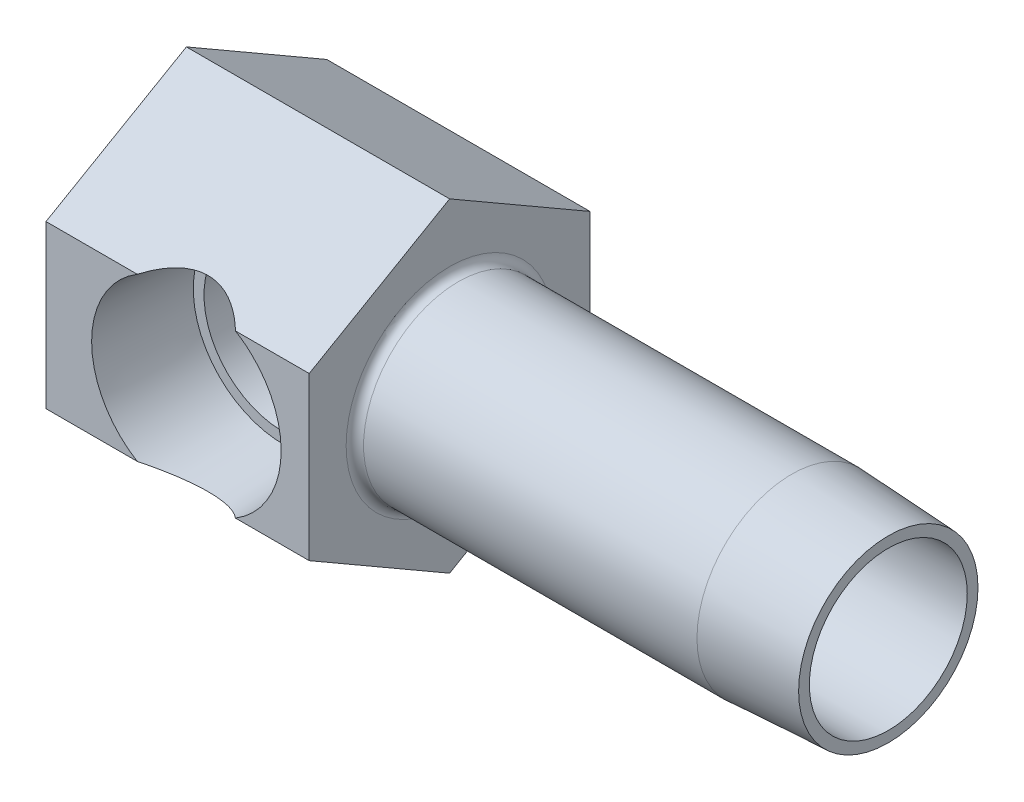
ISO-10303-21;
HEADER;
FILE_DESCRIPTION(('STEP AP214'),'2;1');
FILE_NAME('part.step','',(''),(''),'','','');
FILE_SCHEMA(('AUTOMOTIVE_DESIGN { 1 0 10303 214 1 1 1 1 }'));
ENDSEC;
DATA;
#1=APPLICATION_CONTEXT('core data for automotive mechanical design processes');
#2=APPLICATION_PROTOCOL_DEFINITION('international standard','automotive_design',2000,#1);
#3=PRODUCT_CONTEXT('',#1,'mechanical');
#4=PRODUCT('Part','Part','',(#3));
#5=PRODUCT_RELATED_PRODUCT_CATEGORY('part','',(#4));
#6=PRODUCT_DEFINITION_FORMATION('','',#4);
#7=PRODUCT_DEFINITION_CONTEXT('part definition',#1,'design');
#8=PRODUCT_DEFINITION('design','',#6,#7);
#9=PRODUCT_DEFINITION_SHAPE('','',#8);
#10=(LENGTH_UNIT() NAMED_UNIT(*) SI_UNIT(.MILLI.,.METRE.));
#11=(NAMED_UNIT(*) PLANE_ANGLE_UNIT() SI_UNIT($,.RADIAN.));
#12=(NAMED_UNIT(*) SI_UNIT($,.STERADIAN.) SOLID_ANGLE_UNIT());
#13=UNCERTAINTY_MEASURE_WITH_UNIT(LENGTH_MEASURE(1.E-05),#10,'distance_accuracy_value','');
#14=(GEOMETRIC_REPRESENTATION_CONTEXT(3) GLOBAL_UNCERTAINTY_ASSIGNED_CONTEXT((#13)) GLOBAL_UNIT_ASSIGNED_CONTEXT((#10,
#11,#12)) REPRESENTATION_CONTEXT('',''));
#15=CARTESIAN_POINT('',(0.,0.,0.));
#16=DIRECTION('',(0.,0.,1.));
#17=DIRECTION('',(1.,0.,0.));
#18=AXIS2_PLACEMENT_3D('',#15,#16,#17);
#19=CARTESIAN_POINT('',(23.8125,14.6646968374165,12.7));
#20=DIRECTION('',(0.,-0.866025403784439,-0.5));
#21=DIRECTION('',(0.,0.5,-0.866025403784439));
#22=AXIS2_PLACEMENT_3D('',#19,#20,#21);
#23=PLANE('',#22);
#24=CARTESIAN_POINT('',(12.7,-0.84553451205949,39.56450873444));
#25=DIRECTION('',(0.,-0.866025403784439,-0.5));
#26=DIRECTION('',(0.,-0.5,0.866025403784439));
#27=AXIS2_PLACEMENT_3D('',#24,#25,#26);
#28=ELLIPSE('',#27,18.6296608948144,9.27637524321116);
#29=CARTESIAN_POINT('',(17.1412186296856,7.33234841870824,25.4));
#30=VERTEX_POINT('',#29);
#31=CARTESIAN_POINT('',(8.25878137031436,7.33234841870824,25.4));
#32=VERTEX_POINT('',#31);
#33=EDGE_CURVE('E220',#30,#32,#28,.F.);
#34=ORIENTED_EDGE('',*,*,#33,.F.);
#35=DIRECTION('',(-1.,0.,0.));
#36=VECTOR('',#35,1.);
#37=CARTESIAN_POINT('',(23.8125,7.33234841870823,25.4));
#38=LINE('',#37,#36);
#39=CARTESIAN_POINT('',(23.8125,7.33234841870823,25.4));
#40=VERTEX_POINT('',#39);
#41=EDGE_CURVE('E251',#40,#30,#38,.T.);
#42=ORIENTED_EDGE('',*,*,#41,.F.);
#43=DIRECTION('',(0.,-0.5,0.866025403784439));
#44=VECTOR('',#43,1.);
#45=CARTESIAN_POINT('',(23.8125,14.6646968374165,12.7));
#46=LINE('',#45,#44);
#47=CARTESIAN_POINT('',(23.8125,14.6646968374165,12.7));
#48=VERTEX_POINT('',#47);
#49=EDGE_CURVE('E237',#48,#40,#46,.T.);
#50=ORIENTED_EDGE('',*,*,#49,.F.);
#51=DIRECTION('',(-1.,0.,0.));
#52=VECTOR('',#51,1.);
#53=CARTESIAN_POINT('',(23.8125,14.6646968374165,12.7));
#54=LINE('',#53,#52);
#55=CARTESIAN_POINT('',(0.,14.6646968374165,12.7));
#56=VERTEX_POINT('',#55);
#57=EDGE_CURVE('E254',#48,#56,#54,.T.);
#58=ORIENTED_EDGE('',*,*,#57,.T.);
#59=DIRECTION('',(0.,-0.5,0.866025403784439));
#60=VECTOR('',#59,1.);
#61=CARTESIAN_POINT('',(0.,14.6646968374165,12.7));
#62=LINE('',#61,#60);
#63=CARTESIAN_POINT('',(0.,7.33234841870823,25.4));
#64=VERTEX_POINT('',#63);
#65=EDGE_CURVE('E281',#56,#64,#62,.T.);
#66=ORIENTED_EDGE('',*,*,#65,.T.);
#67=EDGE_CURVE('E250',#32,#64,#38,.T.);
#68=ORIENTED_EDGE('',*,*,#67,.F.);
#69=EDGE_LOOP('',(#34,#42,#50,#58,#66,#68));
#70=FACE_BOUND('',#69,.T.);
#71=ADVANCED_FACE('F15',(#70),#23,.F.);
#72=CARTESIAN_POINT('',(23.8125,7.33234841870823,25.4));
#73=DIRECTION('',(0.,0.,-1.));
#74=DIRECTION('',(-1.,0.,0.));
#75=AXIS2_PLACEMENT_3D('',#72,#73,#74);
#76=PLANE('',#75);
#77=CARTESIAN_POINT('',(12.7,0.,25.4));
#78=DIRECTION('',(0.,0.,-1.));
#79=DIRECTION('',(-1.,0.,0.));
#80=AXIS2_PLACEMENT_3D('',#77,#78,#79);
#81=CIRCLE('',#80,8.5725);
#82=CARTESIAN_POINT('',(17.1412186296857,-7.33234841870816,25.4));
#83=VERTEX_POINT('',#82);
#84=EDGE_CURVE('E266',#30,#83,#81,.T.);
#85=ORIENTED_EDGE('',*,*,#84,.T.);
#86=DIRECTION('',(-1.,0.,0.));
#87=VECTOR('',#86,1.);
#88=CARTESIAN_POINT('',(23.8125,-7.33234841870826,25.4));
#89=LINE('',#88,#87);
#90=CARTESIAN_POINT('',(23.8125,-7.33234841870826,25.4));
#91=VERTEX_POINT('',#90);
#92=EDGE_CURVE('E247',#91,#83,#89,.T.);
#93=ORIENTED_EDGE('',*,*,#92,.F.);
#94=DIRECTION('',(0.,-1.,0.));
#95=VECTOR('',#94,1.);
#96=CARTESIAN_POINT('',(23.8125,7.33234841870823,25.4));
#97=LINE('',#96,#95);
#98=EDGE_CURVE('E239',#40,#91,#97,.T.);
#99=ORIENTED_EDGE('',*,*,#98,.F.);
#100=ORIENTED_EDGE('',*,*,#41,.T.);
#101=EDGE_LOOP('',(#85,#93,#99,#100));
#102=FACE_BOUND('',#101,.T.);
#103=ADVANCED_FACE('F188',(#102),#76,.F.);
#104=CARTESIAN_POINT('',(8.25878137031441,-7.33234841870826,25.4));
#105=VERTEX_POINT('',#104);
#106=EDGE_CURVE('E39',#105,#32,#81,.T.);
#107=ORIENTED_EDGE('',*,*,#106,.T.);
#108=ORIENTED_EDGE('',*,*,#67,.T.);
#109=DIRECTION('',(0.,-1.,0.));
#110=VECTOR('',#109,1.);
#111=CARTESIAN_POINT('',(0.,7.33234841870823,25.4));
#112=LINE('',#111,#110);
#113=CARTESIAN_POINT('',(0.,-7.33234841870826,25.4));
#114=VERTEX_POINT('',#113);
#115=EDGE_CURVE('E284',#64,#114,#112,.T.);
#116=ORIENTED_EDGE('',*,*,#115,.T.);
#117=EDGE_CURVE('E246',#105,#114,#89,.T.);
#118=ORIENTED_EDGE('',*,*,#117,.F.);
#119=EDGE_LOOP('',(#107,#108,#116,#118));
#120=FACE_BOUND('',#119,.T.);
#121=ADVANCED_FACE('F186',(#120),#76,.F.);
#122=CARTESIAN_POINT('',(23.8125,-7.33234841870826,25.4));
#123=DIRECTION('',(0.,0.86602540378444,-0.5));
#124=DIRECTION('',(0.,0.5,0.86602540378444));
#125=AXIS2_PLACEMENT_3D('',#122,#123,#124);
#126=PLANE('',#125);
#127=CARTESIAN_POINT('',(12.7,0.845534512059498,39.5645087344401));
#128=DIRECTION('',(0.,0.86602540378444,-0.5));
#129=DIRECTION('',(0.,0.5,0.86602540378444));
#130=AXIS2_PLACEMENT_3D('',#127,#128,#129);
#131=ELLIPSE('',#130,18.6296608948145,9.27637524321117);
#132=EDGE_CURVE('E24',#105,#83,#131,.F.);
#133=ORIENTED_EDGE('',*,*,#132,.F.);
#134=ORIENTED_EDGE('',*,*,#117,.T.);
#135=DIRECTION('',(0.,-0.5,-0.86602540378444));
#136=VECTOR('',#135,1.);
#137=CARTESIAN_POINT('',(0.,-7.33234841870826,25.4));
#138=LINE('',#137,#136);
#139=CARTESIAN_POINT('',(0.,-14.6646968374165,12.7));
#140=VERTEX_POINT('',#139);
#141=EDGE_CURVE('E230',#114,#140,#138,.T.);
#142=ORIENTED_EDGE('',*,*,#141,.T.);
#143=DIRECTION('',(-1.,0.,0.));
#144=VECTOR('',#143,1.);
#145=CARTESIAN_POINT('',(23.8125,-14.6646968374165,12.7));
#146=LINE('',#145,#144);
#147=CARTESIAN_POINT('',(23.8125,-14.6646968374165,12.7));
#148=VERTEX_POINT('',#147);
#149=EDGE_CURVE('E216',#148,#140,#146,.T.);
#150=ORIENTED_EDGE('',*,*,#149,.F.);
#151=DIRECTION('',(0.,-0.5,-0.86602540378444));
#152=VECTOR('',#151,1.);
#153=CARTESIAN_POINT('',(23.8125,-7.33234841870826,25.4));
#154=LINE('',#153,#152);
#155=EDGE_CURVE('E241',#91,#148,#154,.T.);
#156=ORIENTED_EDGE('',*,*,#155,.F.);
#157=ORIENTED_EDGE('',*,*,#92,.T.);
#158=EDGE_LOOP('',(#133,#134,#142,#150,#156,#157));
#159=FACE_BOUND('',#158,.T.);
#160=ADVANCED_FACE('F182',(#159),#126,.F.);
#161=CARTESIAN_POINT('',(23.8125,-14.6646968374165,12.7));
#162=DIRECTION('',(0.,0.866025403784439,0.5));
#163=DIRECTION('',(0.,-0.5,0.866025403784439));
#164=AXIS2_PLACEMENT_3D('',#161,#162,#163);
#165=PLANE('',#164);
#166=DIRECTION('',(0.,0.5,-0.866025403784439));
#167=VECTOR('',#166,1.);
#168=CARTESIAN_POINT('',(0.,-14.6646968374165,12.7));
#169=LINE('',#168,#167);
#170=CARTESIAN_POINT('',(0.,-7.33234841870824,0.));
#171=VERTEX_POINT('',#170);
#172=EDGE_CURVE('E211',#140,#171,#169,.T.);
#173=ORIENTED_EDGE('',*,*,#172,.T.);
#174=DIRECTION('',(-1.,0.,0.));
#175=VECTOR('',#174,1.);
#176=CARTESIAN_POINT('',(23.8125,-7.33234841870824,0.));
#177=LINE('',#176,#175);
#178=CARTESIAN_POINT('',(23.8125,-7.33234841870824,0.));
#179=VERTEX_POINT('',#178);
#180=EDGE_CURVE('E214',#179,#171,#177,.T.);
#181=ORIENTED_EDGE('',*,*,#180,.F.);
#182=DIRECTION('',(0.,0.5,-0.866025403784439));
#183=VECTOR('',#182,1.);
#184=CARTESIAN_POINT('',(23.8125,-14.6646968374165,12.7));
#185=LINE('',#184,#183);
#186=EDGE_CURVE('E235',#148,#179,#185,.T.);
#187=ORIENTED_EDGE('',*,*,#186,.F.);
#188=ORIENTED_EDGE('',*,*,#149,.T.);
#189=EDGE_LOOP('',(#173,#181,#187,#188));
#190=FACE_BOUND('',#189,.T.);
#191=ADVANCED_FACE('F185',(#190),#165,.F.);
#192=CARTESIAN_POINT('',(23.8125,-7.33234841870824,0.));
#193=DIRECTION('',(0.,0.,1.));
#194=DIRECTION('',(0.,-1.,0.));
#195=AXIS2_PLACEMENT_3D('',#192,#193,#194);
#196=PLANE('',#195);
#197=DIRECTION('',(0.,1.,0.));
#198=VECTOR('',#197,1.);
#199=CARTESIAN_POINT('',(0.,-7.33234841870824,0.));
#200=LINE('',#199,#198);
#201=CARTESIAN_POINT('',(0.,7.33234841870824,0.));
#202=VERTEX_POINT('',#201);
#203=EDGE_CURVE('E219',#171,#202,#200,.T.);
#204=ORIENTED_EDGE('',*,*,#203,.T.);
#205=DIRECTION('',(-1.,0.,0.));
#206=VECTOR('',#205,1.);
#207=CARTESIAN_POINT('',(23.8125,7.33234841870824,0.));
#208=LINE('',#207,#206);
#209=CARTESIAN_POINT('',(23.8125,7.33234841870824,0.));
#210=VERTEX_POINT('',#209);
#211=EDGE_CURVE('E257',#210,#202,#208,.T.);
#212=ORIENTED_EDGE('',*,*,#211,.F.);
#213=DIRECTION('',(0.,1.,0.));
#214=VECTOR('',#213,1.);
#215=CARTESIAN_POINT('',(23.8125,-7.33234841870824,0.));
#216=LINE('',#215,#214);
#217=EDGE_CURVE('E232',#179,#210,#216,.T.);
#218=ORIENTED_EDGE('',*,*,#217,.F.);
#219=ORIENTED_EDGE('',*,*,#180,.T.);
#220=EDGE_LOOP('',(#204,#212,#218,#219));
#221=FACE_BOUND('',#220,.T.);
#222=ADVANCED_FACE('F197',(#221),#196,.F.);
#223=CARTESIAN_POINT('',(23.8125,7.33234841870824,0.));
#224=DIRECTION('',(0.,-0.866025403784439,0.5));
#225=DIRECTION('',(0.,-0.5,-0.866025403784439));
#226=AXIS2_PLACEMENT_3D('',#223,#224,#225);
#227=PLANE('',#226);
#228=DIRECTION('',(0.,0.5,0.866025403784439));
#229=VECTOR('',#228,1.);
#230=CARTESIAN_POINT('',(0.,7.33234841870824,0.));
#231=LINE('',#230,#229);
#232=EDGE_CURVE('E225',#202,#56,#231,.T.);
#233=ORIENTED_EDGE('',*,*,#232,.T.);
#234=ORIENTED_EDGE('',*,*,#57,.F.);
#235=DIRECTION('',(0.,0.5,0.866025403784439));
#236=VECTOR('',#235,1.);
#237=CARTESIAN_POINT('',(23.8125,7.33234841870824,0.));
#238=LINE('',#237,#236);
#239=EDGE_CURVE('E234',#210,#48,#238,.T.);
#240=ORIENTED_EDGE('',*,*,#239,.F.);
#241=ORIENTED_EDGE('',*,*,#211,.T.);
#242=EDGE_LOOP('',(#233,#234,#240,#241));
#243=FACE_BOUND('',#242,.T.);
#244=ADVANCED_FACE('F180',(#243),#227,.F.);
#245=CARTESIAN_POINT('',(23.8125,-21.9970452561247,25.4));
#246=DIRECTION('',(-1.,0.,0.));
#247=DIRECTION('',(0.,-1.,0.));
#248=AXIS2_PLACEMENT_3D('',#245,#246,#247);
#249=PLANE('',#248);
#250=CARTESIAN_POINT('',(23.8125,0.,12.7));
#251=DIRECTION('',(-1.,0.,0.));
#252=DIRECTION('',(0.,-1.,0.));
#253=AXIS2_PLACEMENT_3D('',#250,#251,#252);
#254=CIRCLE('',#253,9.3599);
#255=CARTESIAN_POINT('',(23.8125,-9.35989999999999,12.7));
#256=VERTEX_POINT('',#255);
#257=EDGE_CURVE('E261',#256,#256,#254,.T.);
#258=ORIENTED_EDGE('',*,*,#257,.T.);
#259=EDGE_LOOP('',(#258));
#260=FACE_BOUND('',#259,.T.);
#261=ORIENTED_EDGE('',*,*,#186,.T.);
#262=ORIENTED_EDGE('',*,*,#217,.T.);
#263=ORIENTED_EDGE('',*,*,#239,.T.);
#264=ORIENTED_EDGE('',*,*,#49,.T.);
#265=ORIENTED_EDGE('',*,*,#98,.T.);
#266=ORIENTED_EDGE('',*,*,#155,.T.);
#267=EDGE_LOOP('',(#261,#262,#263,#264,#265,#266));
#268=FACE_BOUND('',#267,.T.);
#269=ADVANCED_FACE('F176',(#260,#268),#249,.F.);
#270=CARTESIAN_POINT('',(0.,-21.9970452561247,25.4));
#271=DIRECTION('',(-1.,0.,0.));
#272=DIRECTION('',(0.,-1.,0.));
#273=AXIS2_PLACEMENT_3D('',#270,#271,#272);
#274=PLANE('',#273);
#275=ORIENTED_EDGE('',*,*,#172,.F.);
#276=ORIENTED_EDGE('',*,*,#141,.F.);
#277=ORIENTED_EDGE('',*,*,#115,.F.);
#278=ORIENTED_EDGE('',*,*,#65,.F.);
#279=ORIENTED_EDGE('',*,*,#232,.F.);
#280=ORIENTED_EDGE('',*,*,#203,.F.);
#281=EDGE_LOOP('',(#275,#276,#277,#278,#279,#280));
#282=FACE_BOUND('',#281,.T.);
#283=ADVANCED_FACE('F172',(#282),#274,.T.);
#284=CARTESIAN_POINT('',(63.5,0.,12.7));
#285=DIRECTION('',(-1.,0.,0.));
#286=DIRECTION('',(0.,-1.,0.));
#287=AXIS2_PLACEMENT_3D('',#284,#285,#286);
#288=CYLINDRICAL_SURFACE('',#287,8.5725);
#289=CARTESIAN_POINT('',(54.7624000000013,0.,12.7));
#290=DIRECTION('',(-1.,0.,0.));
#291=DIRECTION('',(0.,0.,1.));
#292=AXIS2_PLACEMENT_3D('',#289,#290,#291);
#293=CIRCLE('',#292,8.5725);
#294=CARTESIAN_POINT('',(54.7624000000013,0.,21.2725));
#295=VERTEX_POINT('',#294);
#296=EDGE_CURVE('E137',#295,#295,#293,.F.);
#297=ORIENTED_EDGE('',*,*,#296,.F.);
#298=EDGE_LOOP('',(#297));
#299=FACE_BOUND('',#298,.T.);
#300=CARTESIAN_POINT('',(24.5999,0.,12.7));
#301=DIRECTION('',(-1.,0.,0.));
#302=DIRECTION('',(0.,-1.,0.));
#303=AXIS2_PLACEMENT_3D('',#300,#301,#302);
#304=CIRCLE('',#303,8.5725);
#305=CARTESIAN_POINT('',(24.5999,-8.57249999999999,12.7));
#306=VERTEX_POINT('',#305);
#307=EDGE_CURVE('E264',#306,#306,#304,.F.);
#308=ORIENTED_EDGE('',*,*,#307,.T.);
#309=EDGE_LOOP('',(#308));
#310=FACE_BOUND('',#309,.T.);
#311=ADVANCED_FACE('F165',(#299,#310),#288,.T.);
#312=CARTESIAN_POINT('',(24.5999,0.,12.7));
#313=DIRECTION('',(-1.,0.,0.));
#314=DIRECTION('',(0.,-1.,0.));
#315=AXIS2_PLACEMENT_3D('',#312,#313,#314);
#316=TOROIDAL_SURFACE('',#315,9.3599,0.7874);
#317=ORIENTED_EDGE('',*,*,#307,.F.);
#318=EDGE_LOOP('',(#317));
#319=FACE_BOUND('',#318,.T.);
#320=ORIENTED_EDGE('',*,*,#257,.F.);
#321=EDGE_LOOP('',(#320));
#322=FACE_BOUND('',#321,.T.);
#323=ADVANCED_FACE('F162',(#319,#322),#316,.F.);
#324=CARTESIAN_POINT('',(12.7,0.,25.4));
#325=DIRECTION('',(0.,0.,1.));
#326=DIRECTION('',(1.,0.,0.));
#327=AXIS2_PLACEMENT_3D('',#324,#325,#326);
#328=CONICAL_SURFACE('',#327,8.5725,0.0523598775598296);
#329=CARTESIAN_POINT('',(18.2237788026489,-5.94425228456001,16.6622));
#330=CARTESIAN_POINT('',(18.2916176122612,-5.88732299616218,16.7476009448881));
#331=CARTESIAN_POINT('',(18.3592795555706,-5.82850059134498,16.8318676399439));
#332=CARTESIAN_POINT('',(18.4939968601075,-5.70702027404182,16.9981035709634));
#333=CARTESIAN_POINT('',(18.5610521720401,-5.64436205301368,17.0800726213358));
#334=CARTESIAN_POINT('',(18.761107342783,-5.45038497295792,17.3227058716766));
#335=CARTESIAN_POINT('',(18.8927964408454,-5.31322998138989,17.479846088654));
#336=CARTESIAN_POINT('',(19.1518580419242,-5.0216447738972,17.785397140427));
#337=CARTESIAN_POINT('',(19.2791735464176,-4.8670541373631,17.933703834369));
#338=CARTESIAN_POINT('',(19.5257752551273,-4.5416930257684,18.2184184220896));
#339=CARTESIAN_POINT('',(19.6450670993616,-4.37093412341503,18.35483469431));
#340=CARTESIAN_POINT('',(19.9295445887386,-3.92497659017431,18.6779693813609));
#341=CARTESIAN_POINT('',(20.0885588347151,-3.63961711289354,18.8565618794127));
#342=CARTESIAN_POINT('',(20.3031266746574,-3.18637161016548,19.0960411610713));
#343=CARTESIAN_POINT('',(20.3705741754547,-3.03133869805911,19.1710418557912));
#344=CARTESIAN_POINT('',(20.4965477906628,-2.71316594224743,19.3107517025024));
#345=CARTESIAN_POINT('',(20.5550753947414,-2.55002745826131,19.3754625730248));
#346=CARTESIAN_POINT('',(20.6538405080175,-2.24208944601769,19.4844409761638));
#347=CARTESIAN_POINT('',(20.6955064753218,-2.09831594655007,19.5303217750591));
#348=CARTESIAN_POINT('',(20.7709604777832,-1.80624508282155,19.6132970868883));
#349=CARTESIAN_POINT('',(20.8047499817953,-1.65794856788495,19.6503932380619));
#350=CARTESIAN_POINT('',(20.8638747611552,-1.35762804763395,19.7152415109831));
#351=CARTESIAN_POINT('',(20.8892082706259,-1.20560327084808,19.7429916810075));
#352=CARTESIAN_POINT('',(20.9309344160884,-0.898862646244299,19.7886706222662));
#353=CARTESIAN_POINT('',(20.9473269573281,-0.744146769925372,19.8065992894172));
#354=CARTESIAN_POINT('',(20.9708773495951,-0.43270553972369,19.8323499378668));
#355=CARTESIAN_POINT('',(20.9780075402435,-0.275975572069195,19.8401416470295));
#356=CARTESIAN_POINT('',(20.9827943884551,0.0378027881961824,19.8453730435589));
#357=CARTESIAN_POINT('',(20.9804510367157,0.194851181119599,19.8428127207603));
#358=CARTESIAN_POINT('',(20.9663398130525,0.508011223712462,19.8273884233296));
#359=CARTESIAN_POINT('',(20.9545719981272,0.664122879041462,19.8145245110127));
#360=CARTESIAN_POINT('',(20.9218545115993,0.974205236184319,19.77873224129));
#361=CARTESIAN_POINT('',(20.9009049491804,1.12817596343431,19.755804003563));
#362=CARTESIAN_POINT('',(20.8514678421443,1.42545941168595,19.701637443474));
#363=CARTESIAN_POINT('',(20.8233975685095,1.56892578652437,19.670858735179));
#364=CARTESIAN_POINT('',(20.7597875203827,1.85215468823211,19.6010144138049));
#365=CARTESIAN_POINT('',(20.7242449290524,1.99191579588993,19.5619456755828));
#366=CARTESIAN_POINT('',(20.6072066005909,2.40450989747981,19.4330773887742));
#367=CARTESIAN_POINT('',(20.5152596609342,2.67089071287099,19.3315714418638));
#368=CARTESIAN_POINT('',(20.3408066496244,3.10208873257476,19.1379689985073));
#369=CARTESIAN_POINT('',(20.2643220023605,3.27264094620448,19.0528363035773));
#370=CARTESIAN_POINT('',(20.1020422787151,3.60309741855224,18.8714152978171));
#371=CARTESIAN_POINT('',(20.0162439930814,3.76299797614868,18.7751231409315));
#372=CARTESIAN_POINT('',(19.7465644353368,4.22699236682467,18.4708514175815));
#373=CARTESIAN_POINT('',(19.550728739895,4.51459085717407,18.2478400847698));
#374=CARTESIAN_POINT('',(19.2565333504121,4.89305951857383,17.9071622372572));
#375=CARTESIAN_POINT('',(19.1663785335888,5.00247887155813,17.8020703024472));
#376=CARTESIAN_POINT('',(18.9830153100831,5.21324568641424,17.5865045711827));
#377=CARTESIAN_POINT('',(18.8898069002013,5.31459313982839,17.4760307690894));
#378=CARTESIAN_POINT('',(18.7018932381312,5.50848003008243,17.2510129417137));
#379=CARTESIAN_POINT('',(18.6072061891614,5.60108407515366,17.1365090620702));
#380=CARTESIAN_POINT('',(18.4163909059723,5.77848578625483,16.9028222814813));
#381=CARTESIAN_POINT('',(18.320263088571,5.86328566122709,16.783640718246));
#382=CARTESIAN_POINT('',(18.2237788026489,5.94425228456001,16.6622));
#383=B_SPLINE_CURVE_WITH_KNOTS('',3,(#329,#330,#331,#332,#333,#334,#335,#336,#337,#338,#339,
#340,#341,#342,#343,#344,#345,#346,#347,#348,#349,#350,#351,#352,#353,#354,#355,#356,#357,#358,
#359,#360,#361,#362,#363,#364,#365,#366,#367,#368,#369,#370,#371,#372,#373,#374,#375,#376,#377,
#378,#379,#380,#381,#382),.UNSPECIFIED.,.F.,.F.,(4,2,2,2,2,2,2,2,2,2,2,2,2,2,2,2,2,2,2,2,2,2,2,
2,2,2,4),(0.,0.369050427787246,0.738130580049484,1.47737063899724,2.22407355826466,
2.97024599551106,4.0822255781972,4.63656388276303,5.19080950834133,5.66002823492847,
6.12915938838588,6.59838844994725,7.0676224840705,7.53825460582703,8.00888718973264,
8.47951692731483,8.95014106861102,9.3978219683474,9.8456719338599,10.7406458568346,
11.3560801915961,11.9717272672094,13.2057730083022,13.7350494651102,14.2643264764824,
14.7893227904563,15.3141700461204),.UNSPECIFIED.);
#384=CARTESIAN_POINT('',(18.2239376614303,-5.94411896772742,16.6624));
#385=VERTEX_POINT('',#384);
#386=CARTESIAN_POINT('',(18.2239376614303,5.94411896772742,16.6624));
#387=VERTEX_POINT('',#386);
#388=EDGE_CURVE('E131',#385,#387,#383,.T.);
#389=ORIENTED_EDGE('',*,*,#388,.F.);
#390=CARTESIAN_POINT('',(12.7,0.,16.6624));
#391=DIRECTION('',(0.,0.,-1.));
#392=DIRECTION('',(-1.,0.,0.));
#393=AXIS2_PLACEMENT_3D('',#390,#391,#392);
#394=CIRCLE('',#393,8.1145817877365);
#395=EDGE_CURVE('E273',#385,#387,#394,.T.);
#396=ORIENTED_EDGE('',*,*,#395,.T.);
#397=EDGE_LOOP('',(#389,#396));
#398=FACE_BOUND('',#397,.T.);
#399=ORIENTED_EDGE('',*,*,#33,.T.);
#400=ORIENTED_EDGE('',*,*,#106,.F.);
#401=ORIENTED_EDGE('',*,*,#132,.T.);
#402=ORIENTED_EDGE('',*,*,#84,.F.);
#403=EDGE_LOOP('',(#399,#400,#401,#402));
#404=FACE_BOUND('',#403,.T.);
#405=ADVANCED_FACE('F17',(#398,#404),#328,.F.);
#406=CARTESIAN_POINT('',(20.8145817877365,0.,16.6624));
#407=DIRECTION('',(0.,0.,1.));
#408=DIRECTION('',(1.,0.,0.));
#409=AXIS2_PLACEMENT_3D('',#406,#407,#408);
#410=PLANE('',#409);
#411=DIRECTION('',(1.,0.,0.));
#412=VECTOR('',#411,1.);
#413=CARTESIAN_POINT('',(66.667520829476,-5.94411896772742,16.6624));
#414=LINE('',#413,#412);
#415=CARTESIAN_POINT('',(16.6624,-5.9441189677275,16.6624));
#416=VERTEX_POINT('',#415);
#417=EDGE_CURVE('E126',#416,#385,#414,.T.);
#418=ORIENTED_EDGE('',*,*,#417,.F.);
#419=CARTESIAN_POINT('',(12.7,0.,16.6624));
#420=DIRECTION('',(0.,0.,-1.));
#421=DIRECTION('',(-1.,0.,0.));
#422=AXIS2_PLACEMENT_3D('',#419,#420,#421);
#423=CIRCLE('',#422,7.14375);
#424=CARTESIAN_POINT('',(16.6624,5.9441189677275,16.6624));
#425=VERTEX_POINT('',#424);
#426=EDGE_CURVE('E122',#416,#425,#423,.T.);
#427=ORIENTED_EDGE('',*,*,#426,.T.);
#428=DIRECTION('',(1.,0.,0.));
#429=VECTOR('',#428,1.);
#430=CARTESIAN_POINT('',(66.667520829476,5.94411896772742,16.6624));
#431=LINE('',#430,#429);
#432=EDGE_CURVE('E123',#387,#425,#431,.F.);
#433=ORIENTED_EDGE('',*,*,#432,.F.);
#434=ORIENTED_EDGE('',*,*,#395,.F.);
#435=EDGE_LOOP('',(#418,#427,#433,#434));
#436=FACE_BOUND('',#435,.T.);
#437=ADVANCED_FACE('F158',(#436),#410,.T.);
#438=CARTESIAN_POINT('',(12.7,0.,34.595573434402));
#439=DIRECTION('',(0.,0.,-1.));
#440=DIRECTION('',(-1.,0.,0.));
#441=AXIS2_PLACEMENT_3D('',#438,#439,#440);
#442=CYLINDRICAL_SURFACE('',#441,7.14375);
#443=CARTESIAN_POINT('',(12.7,0.,12.7));
#444=DIRECTION('',(0.707106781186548,0.,-0.707106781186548));
#445=DIRECTION('',(-0.707106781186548,0.,-0.707106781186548));
#446=AXIS2_PLACEMENT_3D('',#443,#444,#445);
#447=ELLIPSE('',#446,10.1027881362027,7.14375);
#448=CARTESIAN_POINT('',(12.7,7.14375,12.7));
#449=VERTEX_POINT('',#448);
#450=EDGE_CURVE('E124',#425,#449,#447,.F.);
#451=ORIENTED_EDGE('',*,*,#450,.F.);
#452=ORIENTED_EDGE('',*,*,#426,.F.);
#453=CARTESIAN_POINT('',(12.7,-7.14375,12.7));
#454=VERTEX_POINT('',#453);
#455=EDGE_CURVE('E111',#454,#416,#447,.F.);
#456=ORIENTED_EDGE('',*,*,#455,.F.);
#457=CARTESIAN_POINT('',(12.7,0.,12.7));
#458=DIRECTION('',(-0.707106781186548,0.,-0.707106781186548));
#459=DIRECTION('',(0.707106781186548,0.,-0.707106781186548));
#460=AXIS2_PLACEMENT_3D('',#457,#458,#459);
#461=ELLIPSE('',#460,10.1027881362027,7.14375);
#462=CARTESIAN_POINT('',(18.1005540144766,-4.67623570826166,7.2994459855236));
#463=VERTEX_POINT('',#462);
#464=EDGE_CURVE('E107',#463,#454,#461,.T.);
#465=ORIENTED_EDGE('',*,*,#464,.F.);
#466=CARTESIAN_POINT('',(12.7,0.,7.2994459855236));
#467=DIRECTION('',(0.,0.,-1.));
#468=DIRECTION('',(-1.,0.,0.));
#469=AXIS2_PLACEMENT_3D('',#466,#467,#468);
#470=CIRCLE('',#469,7.14375);
#471=CARTESIAN_POINT('',(18.1005540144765,4.67623570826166,7.2994459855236));
#472=VERTEX_POINT('',#471);
#473=EDGE_CURVE('E536',#463,#472,#470,.T.);
#474=ORIENTED_EDGE('',*,*,#473,.T.);
#475=EDGE_CURVE('E31',#449,#472,#461,.T.);
#476=ORIENTED_EDGE('',*,*,#475,.F.);
#477=EDGE_LOOP('',(#451,#452,#456,#465,#474,#476));
#478=FACE_BOUND('',#477,.T.);
#479=ADVANCED_FACE('F120',(#478),#442,.F.);
#480=CARTESIAN_POINT('',(12.7,0.,7.2994459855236));
#481=DIRECTION('',(0.,0.,1.));
#482=DIRECTION('',(1.,0.,0.));
#483=AXIS2_PLACEMENT_3D('',#480,#481,#482);
#484=CONICAL_SURFACE('',#483,7.14375,1.0471975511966);
#485=CARTESIAN_POINT('',(18.1008122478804,4.67646667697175,7.29964598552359));
#486=CARTESIAN_POINT('',(18.0182484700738,4.60263120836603,7.23572166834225));
#487=CARTESIAN_POINT('',(17.9383238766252,4.52571856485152,7.17175555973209));
#488=CARTESIAN_POINT('',(17.7848563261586,4.36518020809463,7.0441228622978));
#489=CARTESIAN_POINT('',(17.7113260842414,4.28154172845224,6.98045709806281));
#490=CARTESIAN_POINT('',(17.5726476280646,4.1079855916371,6.8545747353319));
#491=CARTESIAN_POINT('',(17.5074361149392,4.01812452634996,6.79235056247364));
#492=CARTESIAN_POINT('',(17.3859720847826,3.83151153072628,6.66964834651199));
#493=CARTESIAN_POINT('',(17.3297132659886,3.73476451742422,6.60916909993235));
#494=CARTESIAN_POINT('',(17.2264163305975,3.53345239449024,6.49019348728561));
#495=CARTESIAN_POINT('',(17.1794940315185,3.42880893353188,6.43172867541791));
#496=CARTESIAN_POINT('',(17.0960237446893,3.21346156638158,6.31865082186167));
#497=CARTESIAN_POINT('',(17.0594774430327,3.10275667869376,6.26403840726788));
#498=CARTESIAN_POINT('',(16.996254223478,2.87633249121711,6.15970832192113));
#499=CARTESIAN_POINT('',(16.9695794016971,2.76061213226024,6.10999169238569));
#500=CARTESIAN_POINT('',(16.9248366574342,2.52527852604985,6.01627423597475));
#501=CARTESIAN_POINT('',(16.9067703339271,2.40566455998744,5.97227447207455));
#502=CARTESIAN_POINT('',(16.872150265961,2.11917129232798,5.87557836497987));
#503=CARTESIAN_POINT('',(16.8585719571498,1.95102064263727,5.82559588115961));
#504=CARTESIAN_POINT('',(16.8395248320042,1.61106163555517,5.73806695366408));
#505=CARTESIAN_POINT('',(16.834060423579,1.43925134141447,5.70052727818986));
#506=CARTESIAN_POINT('',(16.8272216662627,1.09272483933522,5.63811598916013));
#507=CARTESIAN_POINT('',(16.8258602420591,0.918001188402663,5.61328461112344));
#508=CARTESIAN_POINT('',(16.8244844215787,0.567245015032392,5.576623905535));
#509=CARTESIAN_POINT('',(16.8244696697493,0.391212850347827,5.56479114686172));
#510=CARTESIAN_POINT('',(16.8244315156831,0.0298631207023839,5.55391234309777));
#511=CARTESIAN_POINT('',(16.8244077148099,-0.155475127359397,5.55554105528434));
#512=CARTESIAN_POINT('',(16.8245481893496,-0.525517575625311,5.57319743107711));
#513=CARTESIAN_POINT('',(16.8247125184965,-0.710221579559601,5.58922920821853));
#514=CARTESIAN_POINT('',(16.8272365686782,-1.07761401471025,5.63557061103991));
#515=CARTESIAN_POINT('',(16.8295939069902,-1.26030441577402,5.66586472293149));
#516=CARTESIAN_POINT('',(16.8402108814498,-1.62260116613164,5.74051131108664));
#517=CARTESIAN_POINT('',(16.8484676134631,-1.80220898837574,5.78485686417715));
#518=CARTESIAN_POINT('',(16.8713785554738,-2.09762253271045,5.87004472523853));
#519=CARTESIAN_POINT('',(16.8829850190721,-2.21474934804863,5.90713222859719));
#520=CARTESIAN_POINT('',(16.9127302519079,-2.44618190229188,5.98700326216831));
#521=CARTESIAN_POINT('',(16.9308663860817,-2.56048875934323,6.02978449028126));
#522=CARTESIAN_POINT('',(16.9750927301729,-2.78506409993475,6.12039584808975));
#523=CARTESIAN_POINT('',(17.0011553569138,-2.89534512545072,6.16820809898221));
#524=CARTESIAN_POINT('',(17.0623258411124,-3.11130073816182,6.26827147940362));
#525=CARTESIAN_POINT('',(17.0974329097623,-3.21697572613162,6.3205222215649));
#526=CARTESIAN_POINT('',(17.1773511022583,-3.42340093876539,6.42886299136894));
#527=CARTESIAN_POINT('',(17.2222166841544,-3.52411947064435,6.48497330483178));
#528=CARTESIAN_POINT('',(17.3212699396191,-3.71931545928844,6.59977977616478));
#529=CARTESIAN_POINT('',(17.3754591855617,-3.81379185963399,6.65847636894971));
#530=CARTESIAN_POINT('',(17.4924791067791,-3.99641031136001,6.77768652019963));
#531=CARTESIAN_POINT('',(17.5553313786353,-4.08453566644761,6.83820431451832));
#532=CARTESIAN_POINT('',(17.6884734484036,-4.25426378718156,6.96019752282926));
#533=CARTESIAN_POINT('',(17.758764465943,-4.3358654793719,7.02167309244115));
#534=CARTESIAN_POINT('',(17.8750599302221,-4.46018946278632,7.11938400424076));
#535=CARTESIAN_POINT('',(17.9190095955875,-4.5049692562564,7.15548532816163));
#536=CARTESIAN_POINT('',(18.0086324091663,-4.59230195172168,7.22760435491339));
#537=CARTESIAN_POINT('',(18.0542970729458,-4.6348638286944,7.26362172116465));
#538=CARTESIAN_POINT('',(18.1008122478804,-4.67646667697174,7.29964598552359));
#539=B_SPLINE_CURVE_WITH_KNOTS('',3,(#485,#486,#487,#488,#489,#490,#491,#492,#493,#494,#495,
#496,#497,#498,#499,#500,#501,#502,#503,#504,#505,#506,#507,#508,#509,#510,#511,#512,#513,#514,
#515,#516,#517,#518,#519,#520,#521,#522,#523,#524,#525,#526,#527,#528,#529,#530,#531,#532,#533,
#534,#535,#536,#537,#538),.UNSPECIFIED.,.F.,.F.,(4,2,2,2,2,2,2,2,2,2,2,2,2,2,2,2,2,2,2,2,2,2,2,
2,2,2,4),(0.,0.383734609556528,0.768215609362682,1.14957007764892,1.530654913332,
1.91620690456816,2.30182151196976,2.68751795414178,3.07328600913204,3.60029069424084,
4.12758157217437,4.65653172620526,5.18534222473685,5.74081422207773,6.29644491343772,
6.8514726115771,7.40622727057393,7.77616444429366,8.14595249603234,8.5144681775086,
8.8829517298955,9.25354694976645,9.62420472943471,9.99580384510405,10.3674639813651,
10.5845818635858,10.8007392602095),.UNSPECIFIED.);
#540=EDGE_CURVE('E113',#472,#463,#539,.T.);
#541=ORIENTED_EDGE('',*,*,#540,.F.);
#542=ORIENTED_EDGE('',*,*,#473,.F.);
#543=EDGE_LOOP('',(#541,#542));
#544=FACE_BOUND('',#543,.T.);
#545=CARTESIAN_POINT('',(12.7,0.,3.1750000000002));
#546=VERTEX_POINT('',#545);
#547=VERTEX_LOOP('',#546);
#548=FACE_BOUND('',#547,.T.);
#549=ADVANCED_FACE('F151',(#544,#548),#484,.F.);
#550=CARTESIAN_POINT('',(63.5152014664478,0.,12.7));
#551=DIRECTION('',(-1.,0.,0.));
#552=DIRECTION('',(0.,0.,1.));
#553=AXIS2_PLACEMENT_3D('',#550,#551,#552);
#554=CONICAL_SURFACE('',#553,8.1137851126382,0.0523598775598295);
#555=ORIENTED_EDGE('',*,*,#296,.T.);
#556=EDGE_LOOP('',(#555));
#557=FACE_BOUND('',#556,.T.);
#558=CARTESIAN_POINT('',(63.5,0.,12.7));
#559=DIRECTION('',(-1.,0.,0.));
#560=DIRECTION('',(0.,-1.,0.));
#561=AXIS2_PLACEMENT_3D('',#558,#559,#560);
#562=CIRCLE('',#561,8.11458178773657);
#563=CARTESIAN_POINT('',(63.5,-8.11458178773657,12.7));
#564=VERTEX_POINT('',#563);
#565=EDGE_CURVE('E10',#564,#564,#562,.F.);
#566=ORIENTED_EDGE('',*,*,#565,.F.);
#567=EDGE_LOOP('',(#566));
#568=FACE_BOUND('',#567,.T.);
#569=ADVANCED_FACE('F143',(#557,#568),#554,.T.);
#570=CARTESIAN_POINT('',(63.5,0.,12.7));
#571=DIRECTION('',(-1.,0.,0.));
#572=DIRECTION('',(0.,-1.,0.));
#573=AXIS2_PLACEMENT_3D('',#570,#571,#572);
#574=PLANE('',#573);
#575=CARTESIAN_POINT('',(63.5,0.,12.7));
#576=DIRECTION('',(1.,0.,0.));
#577=DIRECTION('',(0.,0.,-1.));
#578=AXIS2_PLACEMENT_3D('',#575,#576,#577);
#579=CIRCLE('',#578,7.1437499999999);
#580=CARTESIAN_POINT('',(63.5,0.,5.5562500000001));
#581=VERTEX_POINT('',#580);
#582=EDGE_CURVE('E150',#581,#581,#579,.T.);
#583=ORIENTED_EDGE('',*,*,#582,.F.);
#584=EDGE_LOOP('',(#583));
#585=FACE_BOUND('',#584,.T.);
#586=ORIENTED_EDGE('',*,*,#565,.T.);
#587=EDGE_LOOP('',(#586));
#588=FACE_BOUND('',#587,.T.);
#589=ADVANCED_FACE('F142',(#585,#588),#574,.F.);
#590=CARTESIAN_POINT('',(66.667520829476,0.,12.7));
#591=DIRECTION('',(1.,0.,0.));
#592=DIRECTION('',(0.,0.,-1.));
#593=AXIS2_PLACEMENT_3D('',#590,#591,#592);
#594=CYLINDRICAL_SURFACE('',#593,7.1437499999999);
#595=ORIENTED_EDGE('',*,*,#388,.T.);
#596=ORIENTED_EDGE('',*,*,#432,.T.);
#597=ORIENTED_EDGE('',*,*,#450,.T.);
#598=ORIENTED_EDGE('',*,*,#475,.T.);
#599=ORIENTED_EDGE('',*,*,#540,.T.);
#600=ORIENTED_EDGE('',*,*,#464,.T.);
#601=ORIENTED_EDGE('',*,*,#455,.T.);
#602=ORIENTED_EDGE('',*,*,#417,.T.);
#603=EDGE_LOOP('',(#595,#596,#597,#598,#599,#600,#601,#602));
#604=FACE_BOUND('',#603,.T.);
#605=ORIENTED_EDGE('',*,*,#582,.T.);
#606=EDGE_LOOP('',(#605));
#607=FACE_BOUND('',#606,.T.);
#608=ADVANCED_FACE('F109',(#604,#607),#594,.F.);
#609=CLOSED_SHELL('',(#71,#103,#121,#160,#191,#222,#244,#269,#283,#311,#323,#405,#437,#479,#549,
#569,#589,#608));
#610=MANIFOLD_SOLID_BREP('B1',#609);
#611=ADVANCED_BREP_SHAPE_REPRESENTATION('',(#18,#610),#14);
#612=SHAPE_DEFINITION_REPRESENTATION(#9,#611);
ENDSEC;
END-ISO-10303-21;
